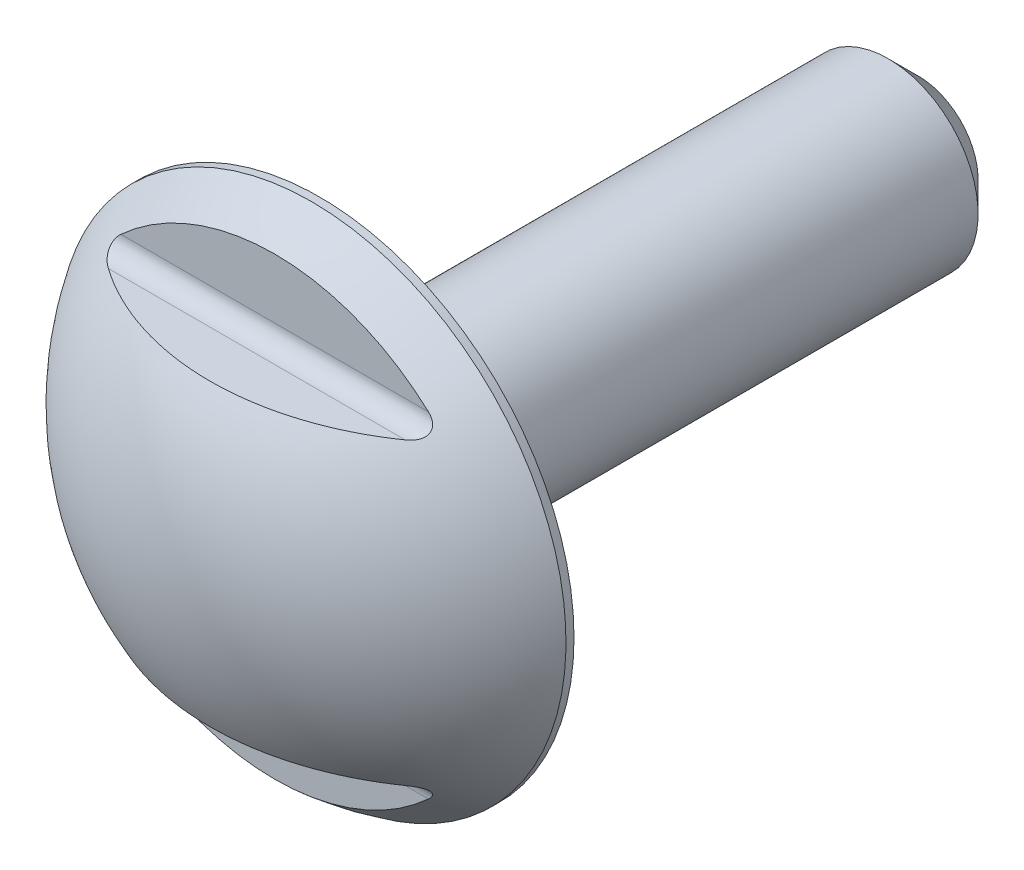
ISO-10303-21;
HEADER;
FILE_DESCRIPTION(('STEP AP214'),'2;1');
FILE_NAME('part.step','',(''),(''),'','','');
FILE_SCHEMA(('AUTOMOTIVE_DESIGN { 1 0 10303 214 1 1 1 1 }'));
ENDSEC;
DATA;
#1=APPLICATION_CONTEXT('core data for automotive mechanical design processes');
#2=APPLICATION_PROTOCOL_DEFINITION('international standard','automotive_design',2000,#1);
#3=PRODUCT_CONTEXT('',#1,'mechanical');
#4=PRODUCT('Part','Part','',(#3));
#5=PRODUCT_RELATED_PRODUCT_CATEGORY('part','',(#4));
#6=PRODUCT_DEFINITION_FORMATION('','',#4);
#7=PRODUCT_DEFINITION_CONTEXT('part definition',#1,'design');
#8=PRODUCT_DEFINITION('design','',#6,#7);
#9=PRODUCT_DEFINITION_SHAPE('','',#8);
#10=(LENGTH_UNIT() NAMED_UNIT(*) SI_UNIT(.MILLI.,.METRE.));
#11=(NAMED_UNIT(*) PLANE_ANGLE_UNIT() SI_UNIT($,.RADIAN.));
#12=(NAMED_UNIT(*) SI_UNIT($,.STERADIAN.) SOLID_ANGLE_UNIT());
#13=UNCERTAINTY_MEASURE_WITH_UNIT(LENGTH_MEASURE(1.E-05),#10,'distance_accuracy_value','');
#14=(GEOMETRIC_REPRESENTATION_CONTEXT(3) GLOBAL_UNCERTAINTY_ASSIGNED_CONTEXT((#13)) GLOBAL_UNIT_ASSIGNED_CONTEXT((#10,
#11,#12)) REPRESENTATION_CONTEXT('',''));
#15=CARTESIAN_POINT('',(0.,0.,0.));
#16=DIRECTION('',(0.,0.,1.));
#17=DIRECTION('',(1.,0.,0.));
#18=AXIS2_PLACEMENT_3D('',#15,#16,#17);
#19=CARTESIAN_POINT('',(0.,0.,-5.));
#20=DIRECTION('',(0.,0.,-1.));
#21=DIRECTION('',(0.,1.,0.));
#22=AXIS2_PLACEMENT_3D('',#19,#20,#21);
#23=SPHERICAL_SURFACE('',#22,10.);
#24=CARTESIAN_POINT('',(-4.9585441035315,5.00000003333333,2.1002));
#25=CARTESIAN_POINT('',(-4.97910716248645,5.00000243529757,2.0858379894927));
#26=CARTESIAN_POINT('',(-4.99945315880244,5.00050663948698,2.07114076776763));
#27=CARTESIAN_POINT('',(-5.03962102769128,5.0027138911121,2.0410018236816));
#28=CARTESIAN_POINT('',(-5.0594409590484,5.00442087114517,2.02555781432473));
#29=CARTESIAN_POINT('',(-5.09856220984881,5.0092602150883,1.99375610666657));
#30=CARTESIAN_POINT('',(-5.11785448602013,5.01240939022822,1.97738968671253));
#31=CARTESIAN_POINT('',(-5.15539462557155,5.02039881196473,1.94392893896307));
#32=CARTESIAN_POINT('',(-5.17364394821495,5.02523662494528,1.92683568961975));
#33=CARTESIAN_POINT('',(-5.2083955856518,5.03680791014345,1.89230014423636));
#34=CARTESIAN_POINT('',(-5.22492700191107,5.04349844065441,1.87487322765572));
#35=CARTESIAN_POINT('',(-5.25616977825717,5.05918155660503,1.83944291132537));
#36=CARTESIAN_POINT('',(-5.2708834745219,5.06817114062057,1.82144028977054));
#37=CARTESIAN_POINT('',(-5.29800007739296,5.08900635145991,1.78482466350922));
#38=CARTESIAN_POINT('',(-5.3103681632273,5.10088980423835,1.76620665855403));
#39=CARTESIAN_POINT('',(-5.33150201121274,5.12776957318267,1.72916760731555));
#40=CARTESIAN_POINT('',(-5.34027826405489,5.14275662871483,1.71074614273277));
#41=CARTESIAN_POINT('',(-5.35123329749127,5.17082101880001,1.68036107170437));
#42=CARTESIAN_POINT('',(-5.35460028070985,5.18312864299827,1.66811401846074));
#43=CARTESIAN_POINT('',(-5.35877261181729,5.20901124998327,1.64455174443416));
#44=CARTESIAN_POINT('',(-5.35957913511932,5.22258564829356,1.63323609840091));
#45=CARTESIAN_POINT('',(-5.35855478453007,5.25062821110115,1.61189118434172));
#46=CARTESIAN_POINT('',(-5.35672223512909,5.2650969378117,1.60186273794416));
#47=CARTESIAN_POINT('',(-5.35058554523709,5.29445902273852,1.58333115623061));
#48=CARTESIAN_POINT('',(-5.34628185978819,5.30935230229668,1.57482774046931));
#49=CARTESIAN_POINT('',(-5.33404114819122,5.34329195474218,1.55726630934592));
#50=CARTESIAN_POINT('',(-5.32542893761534,5.36234935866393,1.54870370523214));
#51=CARTESIAN_POINT('',(-5.30544866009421,5.40003907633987,1.53393504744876));
#52=CARTESIAN_POINT('',(-5.29406310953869,5.41866783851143,1.52774461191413));
#53=CARTESIAN_POINT('',(-5.26133859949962,5.46675764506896,1.51415757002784));
#54=CARTESIAN_POINT('',(-5.23828499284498,5.49554354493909,1.50851297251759));
#55=CARTESIAN_POINT('',(-5.20150205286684,5.53650777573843,1.50321404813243));
#56=CARTESIAN_POINT('',(-5.18899710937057,5.54968354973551,1.50197312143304));
#57=CARTESIAN_POINT('',(-5.16338098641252,5.57539598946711,1.50036793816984));
#58=CARTESIAN_POINT('',(-5.15027215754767,5.58793478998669,1.50000053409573));
#59=CARTESIAN_POINT('',(-5.13690174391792,5.6002,1.50000003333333));
#60=B_SPLINE_CURVE_WITH_KNOTS('',3,(#24,#25,#26,#27,#28,#29,#30,#31,#32,#33,#34,#35,#36,#37,#38,
#39,#40,#41,#42,#43,#44,#45,#46,#47,#48,#49,#50,#51,#52,#53,#54,#55,#56,#57,#58,#59),
.UNSPECIFIED.,.F.,.F.,(4,2,2,2,2,2,2,2,2,2,2,2,2,2,2,2,2,4),(0.,0.0752587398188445,
0.15076469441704,0.227174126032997,0.303473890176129,0.378135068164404,0.452699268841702,
0.528296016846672,0.603670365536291,0.656498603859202,0.709302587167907,0.76214010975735,
0.814967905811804,0.882385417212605,0.950239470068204,1.06140231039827,1.11600139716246,
1.17040345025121),.UNSPECIFIED.);
#61=CARTESIAN_POINT('',(-4.95883050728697,5.,2.1));
#62=VERTEX_POINT('',#61);
#63=CARTESIAN_POINT('',(-5.13711981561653,5.6,1.5));
#64=VERTEX_POINT('',#63);
#65=EDGE_CURVE('E65',#62,#64,#60,.T.);
#66=ORIENTED_EDGE('',*,*,#65,.T.);
#67=CARTESIAN_POINT('',(0.,0.,1.5));
#68=DIRECTION('',(0.,0.,1.));
#69=DIRECTION('',(1.,0.,0.));
#70=AXIS2_PLACEMENT_3D('',#67,#68,#69);
#71=CIRCLE('',#70,7.59934207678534);
#72=CARTESIAN_POINT('',(5.13711981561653,5.6,1.5));
#73=VERTEX_POINT('',#72);
#74=EDGE_CURVE('E53',#64,#73,#71,.F.);
#75=ORIENTED_EDGE('',*,*,#74,.T.);
#76=CARTESIAN_POINT('',(5.13690174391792,5.6002,1.50000003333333));
#77=CARTESIAN_POINT('',(5.16100622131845,5.57805722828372,1.5000319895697));
#78=CARTESIAN_POINT('',(5.18445655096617,5.55487857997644,1.50121737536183));
#79=CARTESIAN_POINT('',(5.22914155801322,5.50618309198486,1.50685277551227));
#80=CARTESIAN_POINT('',(5.25033446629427,5.48063460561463,1.51135506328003));
#81=CARTESIAN_POINT('',(5.28259809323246,5.43612392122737,1.522517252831));
#82=CARTESIAN_POINT('',(5.29473863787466,5.41766777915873,1.52802697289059));
#83=CARTESIAN_POINT('',(5.31645519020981,5.38018259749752,1.54136447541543));
#84=CARTESIAN_POINT('',(5.32604381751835,5.36115691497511,1.54918043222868));
#85=CARTESIAN_POINT('',(5.34043814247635,5.32655780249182,1.56565600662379));
#86=CARTESIAN_POINT('',(5.34580546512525,5.31101205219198,1.57387643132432));
#87=CARTESIAN_POINT('',(5.35397907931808,5.28021739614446,1.59200635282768));
#88=CARTESIAN_POINT('',(5.35678589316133,5.26496843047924,1.60191550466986));
#89=CARTESIAN_POINT('',(5.35958090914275,5.23522010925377,1.62326968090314));
#90=CARTESIAN_POINT('',(5.35955910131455,5.2207235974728,1.63472001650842));
#91=CARTESIAN_POINT('',(5.35667361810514,5.19301194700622,1.65875463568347));
#92=CARTESIAN_POINT('',(5.35380916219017,5.17979716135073,1.67133922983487));
#93=CARTESIAN_POINT('',(5.3457212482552,5.15559629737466,1.6965211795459));
#94=CARTESIAN_POINT('',(5.34062643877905,5.14453063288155,1.70908471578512));
#95=CARTESIAN_POINT('',(5.32847459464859,5.12390779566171,1.73448085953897));
#96=CARTESIAN_POINT('',(5.32141698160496,5.11435106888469,1.74731354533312));
#97=CARTESIAN_POINT('',(5.3009048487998,5.0913100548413,1.78083755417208));
#98=CARTESIAN_POINT('',(5.28617486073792,5.07898778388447,1.80154581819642));
#99=CARTESIAN_POINT('',(5.25383402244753,5.05761509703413,1.84240869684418));
#100=CARTESIAN_POINT('',(5.23621376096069,5.04857569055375,1.86256124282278));
#101=CARTESIAN_POINT('',(5.18615605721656,5.02789487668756,1.91565790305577));
#102=CARTESIAN_POINT('',(5.15188520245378,5.0187632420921,1.9478313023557));
#103=CARTESIAN_POINT('',(5.08021663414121,5.00602503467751,2.00952202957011));
#104=CARTESIAN_POINT('',(5.04281552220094,5.00242455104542,2.03903639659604));
#105=CARTESIAN_POINT('',(4.98927947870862,5.00028656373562,2.07845884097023));
#106=CARTESIAN_POINT('',(4.97397059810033,5.00000375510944,2.08942415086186));
#107=CARTESIAN_POINT('',(4.95854410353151,5.00000003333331,2.1002));
#108=B_SPLINE_CURVE_WITH_KNOTS('',3,(#76,#77,#78,#79,#80,#81,#82,#83,#84,#85,#86,#87,#88,#89,
#90,#91,#92,#93,#94,#95,#96,#97,#98,#99,#100,#101,#102,#103,#104,#105,#106,#107),.UNSPECIFIED.,
.F.,.F.,(4,2,2,2,2,2,2,2,2,2,2,2,2,2,2,4),(0.,0.0985065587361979,0.198599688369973,
0.266688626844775,0.334434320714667,0.389366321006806,0.444287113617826,0.499402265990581,
0.554532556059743,0.606832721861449,0.65914831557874,0.743388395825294,0.827908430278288,
0.970760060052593,1.11376884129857,1.17024331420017),.UNSPECIFIED.);
#109=CARTESIAN_POINT('',(4.95883050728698,5.,2.1));
#110=VERTEX_POINT('',#109);
#111=EDGE_CURVE('E58',#73,#110,#108,.T.);
#112=ORIENTED_EDGE('',*,*,#111,.T.);
#113=CARTESIAN_POINT('',(0.,5.,-5.));
#114=DIRECTION('',(0.,1.,0.));
#115=DIRECTION('',(0.,0.,1.));
#116=AXIS2_PLACEMENT_3D('',#113,#114,#115);
#117=CIRCLE('',#116,8.6602540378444);
#118=EDGE_CURVE('E70',#110,#62,#117,.F.);
#119=ORIENTED_EDGE('',*,*,#118,.T.);
#120=EDGE_LOOP('',(#66,#75,#112,#119));
#121=FACE_BOUND('',#120,.T.);
#122=CARTESIAN_POINT('',(0.,0.,0.267826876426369));
#123=DIRECTION('',(0.,0.,-1.));
#124=DIRECTION('',(-1.,0.,0.));
#125=AXIS2_PLACEMENT_3D('',#122,#123,#124);
#126=CIRCLE('',#125,8.5);
#127=CARTESIAN_POINT('',(-8.5,0.,0.267826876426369));
#128=VERTEX_POINT('',#127);
#129=EDGE_CURVE('E59',#128,#128,#126,.T.);
#130=ORIENTED_EDGE('',*,*,#129,.F.);
#131=EDGE_LOOP('',(#130));
#132=FACE_BOUND('',#131,.T.);
#133=CARTESIAN_POINT('',(4.9585441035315,-5.00000003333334,2.1002));
#134=CARTESIAN_POINT('',(4.97910716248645,-5.00000243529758,2.0858379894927));
#135=CARTESIAN_POINT('',(4.99945315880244,-5.00050663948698,2.07114076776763));
#136=CARTESIAN_POINT('',(5.03962102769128,-5.0027138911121,2.0410018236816));
#137=CARTESIAN_POINT('',(5.0594409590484,-5.00442087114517,2.02555781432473));
#138=CARTESIAN_POINT('',(5.09856220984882,-5.0092602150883,1.99375610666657));
#139=CARTESIAN_POINT('',(5.11785448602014,-5.01240939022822,1.97738968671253));
#140=CARTESIAN_POINT('',(5.15539462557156,-5.02039881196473,1.94392893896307));
#141=CARTESIAN_POINT('',(5.17364394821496,-5.02523662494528,1.92683568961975));
#142=CARTESIAN_POINT('',(5.2083955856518,-5.03680791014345,1.89230014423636));
#143=CARTESIAN_POINT('',(5.22492700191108,-5.04349844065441,1.87487322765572));
#144=CARTESIAN_POINT('',(5.25616977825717,-5.05918155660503,1.83944291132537));
#145=CARTESIAN_POINT('',(5.2708834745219,-5.06817114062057,1.82144028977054));
#146=CARTESIAN_POINT('',(5.29800007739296,-5.08900635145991,1.78482466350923));
#147=CARTESIAN_POINT('',(5.31036816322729,-5.10088980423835,1.76620665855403));
#148=CARTESIAN_POINT('',(5.33150201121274,-5.12776957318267,1.72916760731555));
#149=CARTESIAN_POINT('',(5.34027826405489,-5.14275662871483,1.71074614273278));
#150=CARTESIAN_POINT('',(5.35123329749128,-5.17082101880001,1.68036107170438));
#151=CARTESIAN_POINT('',(5.35460028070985,-5.18312864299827,1.66811401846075));
#152=CARTESIAN_POINT('',(5.3587726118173,-5.20901124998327,1.64455174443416));
#153=CARTESIAN_POINT('',(5.35957913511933,-5.22258564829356,1.63323609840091));
#154=CARTESIAN_POINT('',(5.35855478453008,-5.25062821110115,1.61189118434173));
#155=CARTESIAN_POINT('',(5.35672223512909,-5.2650969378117,1.60186273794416));
#156=CARTESIAN_POINT('',(5.35058554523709,-5.29445902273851,1.58333115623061));
#157=CARTESIAN_POINT('',(5.3462818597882,-5.30935230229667,1.57482774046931));
#158=CARTESIAN_POINT('',(5.33404114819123,-5.34329195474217,1.55726630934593));
#159=CARTESIAN_POINT('',(5.32542893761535,-5.36234935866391,1.54870370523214));
#160=CARTESIAN_POINT('',(5.30544866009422,-5.40003907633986,1.53393504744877));
#161=CARTESIAN_POINT('',(5.2940631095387,-5.41866783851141,1.52774461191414));
#162=CARTESIAN_POINT('',(5.26133859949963,-5.46675764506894,1.51415757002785));
#163=CARTESIAN_POINT('',(5.23828499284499,-5.49554354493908,1.50851297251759));
#164=CARTESIAN_POINT('',(5.20150205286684,-5.53650777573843,1.50321404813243));
#165=CARTESIAN_POINT('',(5.18899710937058,-5.54968354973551,1.50197312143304));
#166=CARTESIAN_POINT('',(5.16338098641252,-5.5753959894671,1.50036793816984));
#167=CARTESIAN_POINT('',(5.15027215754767,-5.58793478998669,1.50000053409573));
#168=CARTESIAN_POINT('',(5.13690174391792,-5.6002,1.50000003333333));
#169=B_SPLINE_CURVE_WITH_KNOTS('',3,(#133,#134,#135,#136,#137,#138,#139,#140,#141,#142,#143,
#144,#145,#146,#147,#148,#149,#150,#151,#152,#153,#154,#155,#156,#157,#158,#159,#160,#161,#162,
#163,#164,#165,#166,#167,#168),.UNSPECIFIED.,.F.,.F.,(4,2,2,2,2,2,2,2,2,2,2,2,2,2,2,2,2,4),(0.,
0.0752587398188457,0.150764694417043,0.227174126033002,0.303473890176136,0.378135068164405,
0.452699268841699,0.528296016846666,0.603670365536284,0.656498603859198,0.709302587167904,
0.762140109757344,0.814967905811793,0.882385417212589,0.950239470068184,1.06140231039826,
1.11600139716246,1.17040345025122),.UNSPECIFIED.);
#170=CARTESIAN_POINT('',(4.95883050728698,-5.,2.1));
#171=VERTEX_POINT('',#170);
#172=CARTESIAN_POINT('',(5.13711981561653,-5.6,1.5));
#173=VERTEX_POINT('',#172);
#174=EDGE_CURVE('E116',#171,#173,#169,.T.);
#175=ORIENTED_EDGE('',*,*,#174,.T.);
#176=CARTESIAN_POINT('',(0.,0.,1.5));
#177=DIRECTION('',(0.,0.,1.));
#178=DIRECTION('',(1.,0.,0.));
#179=AXIS2_PLACEMENT_3D('',#176,#177,#178);
#180=CIRCLE('',#179,7.59934207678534);
#181=CARTESIAN_POINT('',(-5.13711981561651,-5.6,1.5));
#182=VERTEX_POINT('',#181);
#183=EDGE_CURVE('E123',#173,#182,#180,.F.);
#184=ORIENTED_EDGE('',*,*,#183,.T.);
#185=CARTESIAN_POINT('',(-5.13690174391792,-5.6002,1.50000003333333));
#186=CARTESIAN_POINT('',(-5.16100622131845,-5.57805722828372,1.5000319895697));
#187=CARTESIAN_POINT('',(-5.18445655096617,-5.55487857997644,1.50121737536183));
#188=CARTESIAN_POINT('',(-5.22914155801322,-5.50618309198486,1.50685277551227));
#189=CARTESIAN_POINT('',(-5.25033446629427,-5.48063460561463,1.51135506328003));
#190=CARTESIAN_POINT('',(-5.28259809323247,-5.43612392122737,1.522517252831));
#191=CARTESIAN_POINT('',(-5.29473863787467,-5.41766777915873,1.52802697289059));
#192=CARTESIAN_POINT('',(-5.31645519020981,-5.38018259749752,1.54136447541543));
#193=CARTESIAN_POINT('',(-5.32604381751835,-5.36115691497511,1.54918043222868));
#194=CARTESIAN_POINT('',(-5.34043814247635,-5.32655780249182,1.56565600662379));
#195=CARTESIAN_POINT('',(-5.34580546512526,-5.31101205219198,1.57387643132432));
#196=CARTESIAN_POINT('',(-5.35397907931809,-5.28021739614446,1.59200635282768));
#197=CARTESIAN_POINT('',(-5.35678589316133,-5.26496843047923,1.60191550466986));
#198=CARTESIAN_POINT('',(-5.35958090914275,-5.23522010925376,1.62326968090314));
#199=CARTESIAN_POINT('',(-5.35955910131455,-5.22072359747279,1.63472001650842));
#200=CARTESIAN_POINT('',(-5.35667361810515,-5.19301194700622,1.65875463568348));
#201=CARTESIAN_POINT('',(-5.35380916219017,-5.17979716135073,1.67133922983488));
#202=CARTESIAN_POINT('',(-5.3457212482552,-5.15559629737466,1.69652117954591));
#203=CARTESIAN_POINT('',(-5.34062643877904,-5.14453063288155,1.70908471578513));
#204=CARTESIAN_POINT('',(-5.32847459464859,-5.1239077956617,1.73448085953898));
#205=CARTESIAN_POINT('',(-5.32141698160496,-5.11435106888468,1.74731354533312));
#206=CARTESIAN_POINT('',(-5.3009048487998,-5.09131005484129,1.78083755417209));
#207=CARTESIAN_POINT('',(-5.28617486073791,-5.07898778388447,1.80154581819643));
#208=CARTESIAN_POINT('',(-5.25383402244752,-5.05761509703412,1.84240869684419));
#209=CARTESIAN_POINT('',(-5.23621376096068,-5.04857569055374,1.8625612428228));
#210=CARTESIAN_POINT('',(-5.18615605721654,-5.02789487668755,1.91565790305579));
#211=CARTESIAN_POINT('',(-5.15188520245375,-5.01876324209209,1.94783130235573));
#212=CARTESIAN_POINT('',(-5.08021663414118,-5.00602503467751,2.00952202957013));
#213=CARTESIAN_POINT('',(-5.04281552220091,-5.00242455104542,2.03903639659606));
#214=CARTESIAN_POINT('',(-4.98927947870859,-5.00028656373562,2.07845884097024));
#215=CARTESIAN_POINT('',(-4.97397059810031,-5.00000375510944,2.08942415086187));
#216=CARTESIAN_POINT('',(-4.95854410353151,-5.00000003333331,2.1002));
#217=B_SPLINE_CURVE_WITH_KNOTS('',3,(#185,#186,#187,#188,#189,#190,#191,#192,#193,#194,#195,
#196,#197,#198,#199,#200,#201,#202,#203,#204,#205,#206,#207,#208,#209,#210,#211,#212,#213,#214,
#215,#216),.UNSPECIFIED.,.F.,.F.,(4,2,2,2,2,2,2,2,2,2,2,2,2,2,2,4),(0.,0.0985065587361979,
0.198599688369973,0.266688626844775,0.334434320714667,0.389366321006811,0.444287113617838,
0.49940226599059,0.554532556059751,0.606832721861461,0.659148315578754,0.743388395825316,
0.827908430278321,0.970760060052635,1.11376884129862,1.17024331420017),.UNSPECIFIED.);
#218=CARTESIAN_POINT('',(-4.95883050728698,-5.,2.1));
#219=VERTEX_POINT('',#218);
#220=EDGE_CURVE('E110',#182,#219,#217,.T.);
#221=ORIENTED_EDGE('',*,*,#220,.T.);
#222=CARTESIAN_POINT('',(0.,-5.,-5.));
#223=DIRECTION('',(0.,-1.,0.));
#224=DIRECTION('',(0.,0.,-1.));
#225=AXIS2_PLACEMENT_3D('',#222,#223,#224);
#226=CIRCLE('',#225,8.6602540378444);
#227=EDGE_CURVE('E72',#219,#171,#226,.F.);
#228=ORIENTED_EDGE('',*,*,#227,.T.);
#229=EDGE_LOOP('',(#175,#184,#221,#228));
#230=FACE_BOUND('',#229,.T.);
#231=ADVANCED_FACE('F14',(#121,#132,#230),#23,.T.);
#232=CARTESIAN_POINT('',(0.,0.,-10.));
#233=DIRECTION('',(0.,0.,-1.));
#234=DIRECTION('',(-1.,0.,0.));
#235=AXIS2_PLACEMENT_3D('',#232,#233,#234);
#236=CYLINDRICAL_SURFACE('',#235,8.5);
#237=CARTESIAN_POINT('',(0.,0.,0.));
#238=DIRECTION('',(0.,0.,-1.));
#239=DIRECTION('',(-1.,0.,0.));
#240=AXIS2_PLACEMENT_3D('',#237,#238,#239);
#241=CIRCLE('',#240,8.5);
#242=CARTESIAN_POINT('',(-8.5,0.,0.));
#243=VERTEX_POINT('',#242);
#244=EDGE_CURVE('E194',#243,#243,#241,.T.);
#245=ORIENTED_EDGE('',*,*,#244,.F.);
#246=EDGE_LOOP('',(#245));
#247=FACE_BOUND('',#246,.T.);
#248=ORIENTED_EDGE('',*,*,#129,.T.);
#249=EDGE_LOOP('',(#248));
#250=FACE_BOUND('',#249,.T.);
#251=ADVANCED_FACE('F137',(#247,#250),#236,.T.);
#252=CARTESIAN_POINT('',(0.,8.5,0.));
#253=DIRECTION('',(0.,0.,1.));
#254=DIRECTION('',(1.,0.,0.));
#255=AXIS2_PLACEMENT_3D('',#252,#253,#254);
#256=PLANE('',#255);
#257=CARTESIAN_POINT('',(0.,0.,0.));
#258=DIRECTION('',(0.,0.,-1.));
#259=DIRECTION('',(-1.,0.,0.));
#260=AXIS2_PLACEMENT_3D('',#257,#258,#259);
#261=CIRCLE('',#260,2.7);
#262=CARTESIAN_POINT('',(-2.7,0.,0.));
#263=VERTEX_POINT('',#262);
#264=EDGE_CURVE('E191',#263,#263,#261,.T.);
#265=ORIENTED_EDGE('',*,*,#264,.F.);
#266=EDGE_LOOP('',(#265));
#267=FACE_BOUND('',#266,.T.);
#268=ORIENTED_EDGE('',*,*,#244,.T.);
#269=EDGE_LOOP('',(#268));
#270=FACE_BOUND('',#269,.T.);
#271=ADVANCED_FACE('F141',(#267,#270),#256,.F.);
#272=CARTESIAN_POINT('',(0.,0.,-0.5));
#273=DIRECTION('',(0.,0.,-1.));
#274=DIRECTION('',(-1.,0.,0.));
#275=AXIS2_PLACEMENT_3D('',#272,#273,#274);
#276=TOROIDAL_SURFACE('',#275,2.7,0.5);
#277=CARTESIAN_POINT('',(0.,0.,-0.5));
#278=DIRECTION('',(0.,0.,-1.));
#279=DIRECTION('',(-1.,0.,0.));
#280=AXIS2_PLACEMENT_3D('',#277,#278,#279);
#281=CIRCLE('',#280,2.2);
#282=CARTESIAN_POINT('',(-2.2,0.,-0.5));
#283=VERTEX_POINT('',#282);
#284=EDGE_CURVE('E188',#283,#283,#281,.T.);
#285=ORIENTED_EDGE('',*,*,#284,.F.);
#286=EDGE_LOOP('',(#285));
#287=FACE_BOUND('',#286,.T.);
#288=ORIENTED_EDGE('',*,*,#264,.T.);
#289=EDGE_LOOP('',(#288));
#290=FACE_BOUND('',#289,.T.);
#291=ADVANCED_FACE('F146',(#287,#290),#276,.F.);
#292=CARTESIAN_POINT('',(0.,0.,-10.));
#293=DIRECTION('',(0.,0.,-1.));
#294=DIRECTION('',(-1.,0.,0.));
#295=AXIS2_PLACEMENT_3D('',#292,#293,#294);
#296=CYLINDRICAL_SURFACE('',#295,2.2);
#297=CARTESIAN_POINT('',(0.,0.,-0.580384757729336));
#298=DIRECTION('',(0.,0.,-1.));
#299=DIRECTION('',(-1.,0.,0.));
#300=AXIS2_PLACEMENT_3D('',#297,#298,#299);
#301=CIRCLE('',#300,2.2);
#302=CARTESIAN_POINT('',(-2.2,0.,-0.580384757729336));
#303=VERTEX_POINT('',#302);
#304=EDGE_CURVE('E180',#303,#303,#301,.T.);
#305=ORIENTED_EDGE('',*,*,#304,.F.);
#306=EDGE_LOOP('',(#305));
#307=FACE_BOUND('',#306,.T.);
#308=ORIENTED_EDGE('',*,*,#284,.T.);
#309=EDGE_LOOP('',(#308));
#310=FACE_BOUND('',#309,.T.);
#311=ADVANCED_FACE('F154',(#307,#310),#296,.T.);
#312=CARTESIAN_POINT('',(0.,0.,-0.580384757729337));
#313=DIRECTION('',(0.,0.,-1.));
#314=DIRECTION('',(-1.,0.,0.));
#315=AXIS2_PLACEMENT_3D('',#312,#313,#314);
#316=TOROIDAL_SURFACE('',#315,2.7,0.5);
#317=CARTESIAN_POINT('',(0.,0.,-0.830384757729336));
#318=DIRECTION('',(0.,0.,-1.));
#319=DIRECTION('',(-1.,0.,0.));
#320=AXIS2_PLACEMENT_3D('',#317,#318,#319);
#321=CIRCLE('',#320,2.26698729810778);
#322=CARTESIAN_POINT('',(-2.26698729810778,0.,-0.830384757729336));
#323=VERTEX_POINT('',#322);
#324=EDGE_CURVE('E176',#323,#323,#321,.T.);
#325=ORIENTED_EDGE('',*,*,#324,.F.);
#326=EDGE_LOOP('',(#325));
#327=FACE_BOUND('',#326,.T.);
#328=ORIENTED_EDGE('',*,*,#304,.T.);
#329=EDGE_LOOP('',(#328));
#330=FACE_BOUND('',#329,.T.);
#331=ADVANCED_FACE('F158',(#327,#330),#316,.F.);
#332=CARTESIAN_POINT('',(0.,0.,-0.830384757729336));
#333=DIRECTION('',(0.,0.,-1.));
#334=DIRECTION('',(-1.,0.,0.));
#335=AXIS2_PLACEMENT_3D('',#332,#333,#334);
#336=CONICAL_SURFACE('',#335,2.26698729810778,0.523598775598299);
#337=CARTESIAN_POINT('',(0.,0.,-2.1));
#338=DIRECTION('',(0.,0.,-1.));
#339=DIRECTION('',(-1.,0.,0.));
#340=AXIS2_PLACEMENT_3D('',#337,#338,#339);
#341=CIRCLE('',#340,3.);
#342=CARTESIAN_POINT('',(-3.,0.,-2.1));
#343=VERTEX_POINT('',#342);
#344=EDGE_CURVE('E175',#343,#343,#341,.T.);
#345=ORIENTED_EDGE('',*,*,#344,.F.);
#346=EDGE_LOOP('',(#345));
#347=FACE_BOUND('',#346,.T.);
#348=ORIENTED_EDGE('',*,*,#324,.T.);
#349=EDGE_LOOP('',(#348));
#350=FACE_BOUND('',#349,.T.);
#351=ADVANCED_FACE('F162',(#347,#350),#336,.T.);
#352=CARTESIAN_POINT('',(0.,0.,-10.));
#353=DIRECTION('',(0.,0.,-1.));
#354=DIRECTION('',(-1.,0.,0.));
#355=AXIS2_PLACEMENT_3D('',#352,#353,#354);
#356=CYLINDRICAL_SURFACE('',#355,3.);
#357=CARTESIAN_POINT('',(0.,0.,-19.));
#358=DIRECTION('',(0.,0.,-1.));
#359=DIRECTION('',(-1.,0.,0.));
#360=AXIS2_PLACEMENT_3D('',#357,#358,#359);
#361=CIRCLE('',#360,3.);
#362=CARTESIAN_POINT('',(-3.,0.,-19.));
#363=VERTEX_POINT('',#362);
#364=EDGE_CURVE('E9',#363,#363,#361,.F.);
#365=ORIENTED_EDGE('',*,*,#364,.T.);
#366=EDGE_LOOP('',(#365));
#367=FACE_BOUND('',#366,.T.);
#368=ORIENTED_EDGE('',*,*,#344,.T.);
#369=EDGE_LOOP('',(#368));
#370=FACE_BOUND('',#369,.T.);
#371=ADVANCED_FACE('F165',(#367,#370),#356,.T.);
#372=CARTESIAN_POINT('',(10.5,5.6,1.5));
#373=DIRECTION('',(0.,0.,1.));
#374=DIRECTION('',(1.,0.,0.));
#375=AXIS2_PLACEMENT_3D('',#372,#373,#374);
#376=PLANE('',#375);
#377=DIRECTION('',(-1.,0.,0.));
#378=VECTOR('',#377,1.);
#379=CARTESIAN_POINT('',(10.5,5.6,1.5));
#380=LINE('',#379,#378);
#381=EDGE_CURVE('E35',#73,#64,#380,.T.);
#382=ORIENTED_EDGE('',*,*,#381,.F.);
#383=ORIENTED_EDGE('',*,*,#74,.F.);
#384=EDGE_LOOP('',(#382,#383));
#385=FACE_BOUND('',#384,.T.);
#386=ADVANCED_FACE('F54',(#385),#376,.T.);
#387=CARTESIAN_POINT('',(10.5,5.6,2.1));
#388=DIRECTION('',(-1.,0.,0.));
#389=DIRECTION('',(0.,-1.,0.));
#390=AXIS2_PLACEMENT_3D('',#387,#388,#389);
#391=CYLINDRICAL_SURFACE('',#390,0.6);
#392=DIRECTION('',(-1.,0.,0.));
#393=VECTOR('',#392,1.);
#394=CARTESIAN_POINT('',(10.5,5.,2.1));
#395=LINE('',#394,#393);
#396=EDGE_CURVE('E67',#110,#62,#395,.T.);
#397=ORIENTED_EDGE('',*,*,#396,.F.);
#398=ORIENTED_EDGE('',*,*,#111,.F.);
#399=ORIENTED_EDGE('',*,*,#381,.T.);
#400=ORIENTED_EDGE('',*,*,#65,.F.);
#401=EDGE_LOOP('',(#397,#398,#399,#400));
#402=FACE_BOUND('',#401,.T.);
#403=ADVANCED_FACE('F64',(#402),#391,.F.);
#404=CARTESIAN_POINT('',(10.5,5.,5.));
#405=DIRECTION('',(0.,1.,0.));
#406=DIRECTION('',(0.,0.,1.));
#407=AXIS2_PLACEMENT_3D('',#404,#405,#406);
#408=PLANE('',#407);
#409=ORIENTED_EDGE('',*,*,#118,.F.);
#410=ORIENTED_EDGE('',*,*,#396,.T.);
#411=EDGE_LOOP('',(#409,#410));
#412=FACE_BOUND('',#411,.T.);
#413=ADVANCED_FACE('F91',(#412),#408,.T.);
#414=CARTESIAN_POINT('',(10.5,-13.5,1.5));
#415=DIRECTION('',(0.,0.,1.));
#416=DIRECTION('',(1.,0.,0.));
#417=AXIS2_PLACEMENT_3D('',#414,#415,#416);
#418=PLANE('',#417);
#419=DIRECTION('',(-1.,0.,0.));
#420=VECTOR('',#419,1.);
#421=CARTESIAN_POINT('',(10.5,-5.6,1.5));
#422=LINE('',#421,#420);
#423=EDGE_CURVE('E177',#173,#182,#422,.T.);
#424=ORIENTED_EDGE('',*,*,#423,.T.);
#425=ORIENTED_EDGE('',*,*,#183,.F.);
#426=EDGE_LOOP('',(#424,#425));
#427=FACE_BOUND('',#426,.T.);
#428=ADVANCED_FACE('F96',(#427),#418,.T.);
#429=CARTESIAN_POINT('',(10.5,-5.6,2.1));
#430=DIRECTION('',(-1.,0.,0.));
#431=DIRECTION('',(0.,-1.,0.));
#432=AXIS2_PLACEMENT_3D('',#429,#430,#431);
#433=CYLINDRICAL_SURFACE('',#432,0.6);
#434=DIRECTION('',(-1.,0.,0.));
#435=VECTOR('',#434,1.);
#436=CARTESIAN_POINT('',(10.5,-5.,2.1));
#437=LINE('',#436,#435);
#438=EDGE_CURVE('E28',#171,#219,#437,.T.);
#439=ORIENTED_EDGE('',*,*,#438,.T.);
#440=ORIENTED_EDGE('',*,*,#220,.F.);
#441=ORIENTED_EDGE('',*,*,#423,.F.);
#442=ORIENTED_EDGE('',*,*,#174,.F.);
#443=EDGE_LOOP('',(#439,#440,#441,#442));
#444=FACE_BOUND('',#443,.T.);
#445=ADVANCED_FACE('F102',(#444),#433,.F.);
#446=CARTESIAN_POINT('',(10.5,-5.,2.1));
#447=DIRECTION('',(0.,-1.,0.));
#448=DIRECTION('',(0.,0.,-1.));
#449=AXIS2_PLACEMENT_3D('',#446,#447,#448);
#450=PLANE('',#449);
#451=ORIENTED_EDGE('',*,*,#438,.F.);
#452=ORIENTED_EDGE('',*,*,#227,.F.);
#453=EDGE_LOOP('',(#451,#452));
#454=FACE_BOUND('',#453,.T.);
#455=ADVANCED_FACE('F98',(#454),#450,.T.);
#456=CARTESIAN_POINT('',(0.,0.,-20.));
#457=DIRECTION('',(0.,0.,-1.));
#458=DIRECTION('',(-1.,0.,0.));
#459=AXIS2_PLACEMENT_3D('',#456,#457,#458);
#460=PLANE('',#459);
#461=CARTESIAN_POINT('',(0.,0.,-20.));
#462=DIRECTION('',(0.,0.,-1.));
#463=DIRECTION('',(-1.,0.,0.));
#464=AXIS2_PLACEMENT_3D('',#461,#462,#463);
#465=CIRCLE('',#464,2.);
#466=CARTESIAN_POINT('',(-2.,0.,-20.));
#467=VERTEX_POINT('',#466);
#468=EDGE_CURVE('E22',#467,#467,#465,.T.);
#469=ORIENTED_EDGE('',*,*,#468,.T.);
#470=EDGE_LOOP('',(#469));
#471=FACE_BOUND('',#470,.T.);
#472=ADVANCED_FACE('F101',(#471),#460,.T.);
#473=CARTESIAN_POINT('',(0.,0.,-20.));
#474=DIRECTION('',(0.,0.,1.));
#475=DIRECTION('',(1.,0.,0.));
#476=AXIS2_PLACEMENT_3D('',#473,#474,#475);
#477=CONICAL_SURFACE('',#476,2.,0.785398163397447);
#478=ORIENTED_EDGE('',*,*,#364,.F.);
#479=EDGE_LOOP('',(#478));
#480=FACE_BOUND('',#479,.T.);
#481=ORIENTED_EDGE('',*,*,#468,.F.);
#482=EDGE_LOOP('',(#481));
#483=FACE_BOUND('',#482,.T.);
#484=ADVANCED_FACE('F16',(#480,#483),#477,.T.);
#485=CLOSED_SHELL('',(#231,#251,#271,#291,#311,#331,#351,#371,#386,#403,#413,#428,#445,#455,
#472,#484));
#486=MANIFOLD_SOLID_BREP('B1',#485);
#487=ADVANCED_BREP_SHAPE_REPRESENTATION('',(#18,#486),#14);
#488=SHAPE_DEFINITION_REPRESENTATION(#9,#487);
ENDSEC;
END-ISO-10303-21;
